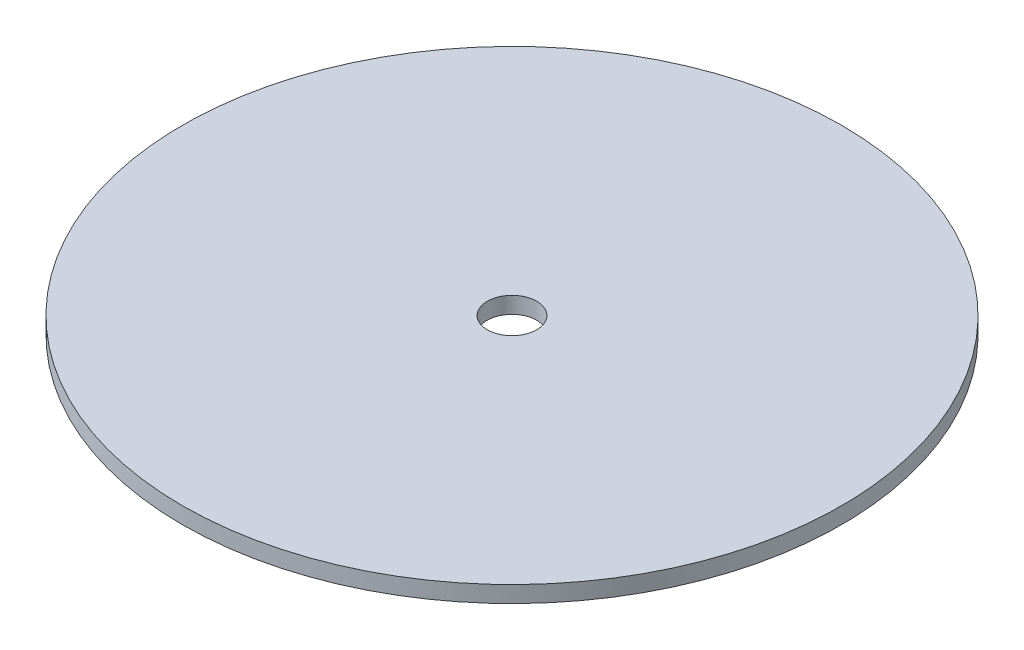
ISO-10303-21;
HEADER;
FILE_DESCRIPTION(('STEP AP214'),'2;1');
FILE_NAME('part.step','',(''),(''),'','','');
FILE_SCHEMA(('AUTOMOTIVE_DESIGN { 1 0 10303 214 1 1 1 1 }'));
ENDSEC;
DATA;
#1=APPLICATION_CONTEXT('core data for automotive mechanical design processes');
#2=APPLICATION_PROTOCOL_DEFINITION('international standard','automotive_design',2000,#1);
#3=PRODUCT_CONTEXT('',#1,'mechanical');
#4=PRODUCT('Part','Part','',(#3));
#5=PRODUCT_RELATED_PRODUCT_CATEGORY('part','',(#4));
#6=PRODUCT_DEFINITION_FORMATION('','',#4);
#7=PRODUCT_DEFINITION_CONTEXT('part definition',#1,'design');
#8=PRODUCT_DEFINITION('design','',#6,#7);
#9=PRODUCT_DEFINITION_SHAPE('','',#8);
#10=(LENGTH_UNIT() NAMED_UNIT(*) SI_UNIT(.MILLI.,.METRE.));
#11=(NAMED_UNIT(*) PLANE_ANGLE_UNIT() SI_UNIT($,.RADIAN.));
#12=(NAMED_UNIT(*) SI_UNIT($,.STERADIAN.) SOLID_ANGLE_UNIT());
#13=UNCERTAINTY_MEASURE_WITH_UNIT(LENGTH_MEASURE(1.E-05),#10,'distance_accuracy_value','');
#14=(GEOMETRIC_REPRESENTATION_CONTEXT(3) GLOBAL_UNCERTAINTY_ASSIGNED_CONTEXT((#13)) GLOBAL_UNIT_ASSIGNED_CONTEXT((#10,
#11,#12)) REPRESENTATION_CONTEXT('',''));
#15=CARTESIAN_POINT('',(0.,0.,0.));
#16=DIRECTION('',(0.,0.,1.));
#17=DIRECTION('',(1.,0.,0.));
#18=AXIS2_PLACEMENT_3D('',#15,#16,#17);
#19=CARTESIAN_POINT('',(0.,20.,0.));
#20=DIRECTION('',(0.,1.,0.));
#21=DIRECTION('',(0.,0.,1.));
#22=AXIS2_PLACEMENT_3D('',#19,#20,#21);
#23=PLANE('',#22);
#24=CARTESIAN_POINT('',(0.,20.,0.));
#25=DIRECTION('',(0.,1.,0.));
#26=DIRECTION('',(0.,0.,1.));
#27=AXIS2_PLACEMENT_3D('',#24,#25,#26);
#28=CIRCLE('',#27,400.);
#29=CARTESIAN_POINT('',(0.,20.,400.));
#30=VERTEX_POINT('',#29);
#31=EDGE_CURVE('E10',#30,#30,#28,.T.);
#32=ORIENTED_EDGE('',*,*,#31,.T.);
#33=EDGE_LOOP('',(#32));
#34=FACE_BOUND('',#33,.T.);
#35=CARTESIAN_POINT('',(0.,20.,0.));
#36=DIRECTION('',(0.,1.,0.));
#37=DIRECTION('',(0.,0.,1.));
#38=AXIS2_PLACEMENT_3D('',#35,#36,#37);
#39=CIRCLE('',#38,30.);
#40=CARTESIAN_POINT('',(0.,20.,30.));
#41=VERTEX_POINT('',#40);
#42=EDGE_CURVE('E42',#41,#41,#39,.T.);
#43=ORIENTED_EDGE('',*,*,#42,.F.);
#44=EDGE_LOOP('',(#43));
#45=FACE_BOUND('',#44,.T.);
#46=ADVANCED_FACE('F31',(#34,#45),#23,.T.);
#47=CARTESIAN_POINT('',(0.,0.,0.));
#48=DIRECTION('',(0.,1.,0.));
#49=DIRECTION('',(0.,0.,1.));
#50=AXIS2_PLACEMENT_3D('',#47,#48,#49);
#51=PLANE('',#50);
#52=CARTESIAN_POINT('',(0.,0.,0.));
#53=DIRECTION('',(0.,1.,0.));
#54=DIRECTION('',(0.,0.,1.));
#55=AXIS2_PLACEMENT_3D('',#52,#53,#54);
#56=CIRCLE('',#55,400.);
#57=CARTESIAN_POINT('',(0.,0.,400.));
#58=VERTEX_POINT('',#57);
#59=EDGE_CURVE('E35',#58,#58,#56,.T.);
#60=ORIENTED_EDGE('',*,*,#59,.F.);
#61=EDGE_LOOP('',(#60));
#62=FACE_BOUND('',#61,.T.);
#63=CARTESIAN_POINT('',(0.,0.,0.));
#64=DIRECTION('',(0.,1.,0.));
#65=DIRECTION('',(0.,0.,1.));
#66=AXIS2_PLACEMENT_3D('',#63,#64,#65);
#67=CIRCLE('',#66,30.);
#68=CARTESIAN_POINT('',(0.,0.,30.));
#69=VERTEX_POINT('',#68);
#70=EDGE_CURVE('E44',#69,#69,#67,.T.);
#71=ORIENTED_EDGE('',*,*,#70,.T.);
#72=EDGE_LOOP('',(#71));
#73=FACE_BOUND('',#72,.T.);
#74=ADVANCED_FACE('F54',(#62,#73),#51,.F.);
#75=CARTESIAN_POINT('',(0.,20.,0.));
#76=DIRECTION('',(0.,-1.,0.));
#77=DIRECTION('',(0.,0.,-1.));
#78=AXIS2_PLACEMENT_3D('',#75,#76,#77);
#79=CYLINDRICAL_SURFACE('',#78,400.);
#80=ORIENTED_EDGE('',*,*,#31,.F.);
#81=EDGE_LOOP('',(#80));
#82=FACE_BOUND('',#81,.T.);
#83=ORIENTED_EDGE('',*,*,#59,.T.);
#84=EDGE_LOOP('',(#83));
#85=FACE_BOUND('',#84,.T.);
#86=ADVANCED_FACE('F33',(#82,#85),#79,.T.);
#87=CARTESIAN_POINT('',(0.,20.,0.));
#88=DIRECTION('',(0.,-1.,0.));
#89=DIRECTION('',(0.,0.,-1.));
#90=AXIS2_PLACEMENT_3D('',#87,#88,#89);
#91=CYLINDRICAL_SURFACE('',#90,30.);
#92=ORIENTED_EDGE('',*,*,#42,.T.);
#93=EDGE_LOOP('',(#92));
#94=FACE_BOUND('',#93,.T.);
#95=ORIENTED_EDGE('',*,*,#70,.F.);
#96=EDGE_LOOP('',(#95));
#97=FACE_BOUND('',#96,.T.);
#98=ADVANCED_FACE('F50',(#94,#97),#91,.F.);
#99=CLOSED_SHELL('',(#46,#74,#86,#98));
#100=MANIFOLD_SOLID_BREP('B2',#99);
#101=ADVANCED_BREP_SHAPE_REPRESENTATION('',(#18,#100),#14);
#102=SHAPE_DEFINITION_REPRESENTATION(#9,#101);
ENDSEC;
END-ISO-10303-21;
